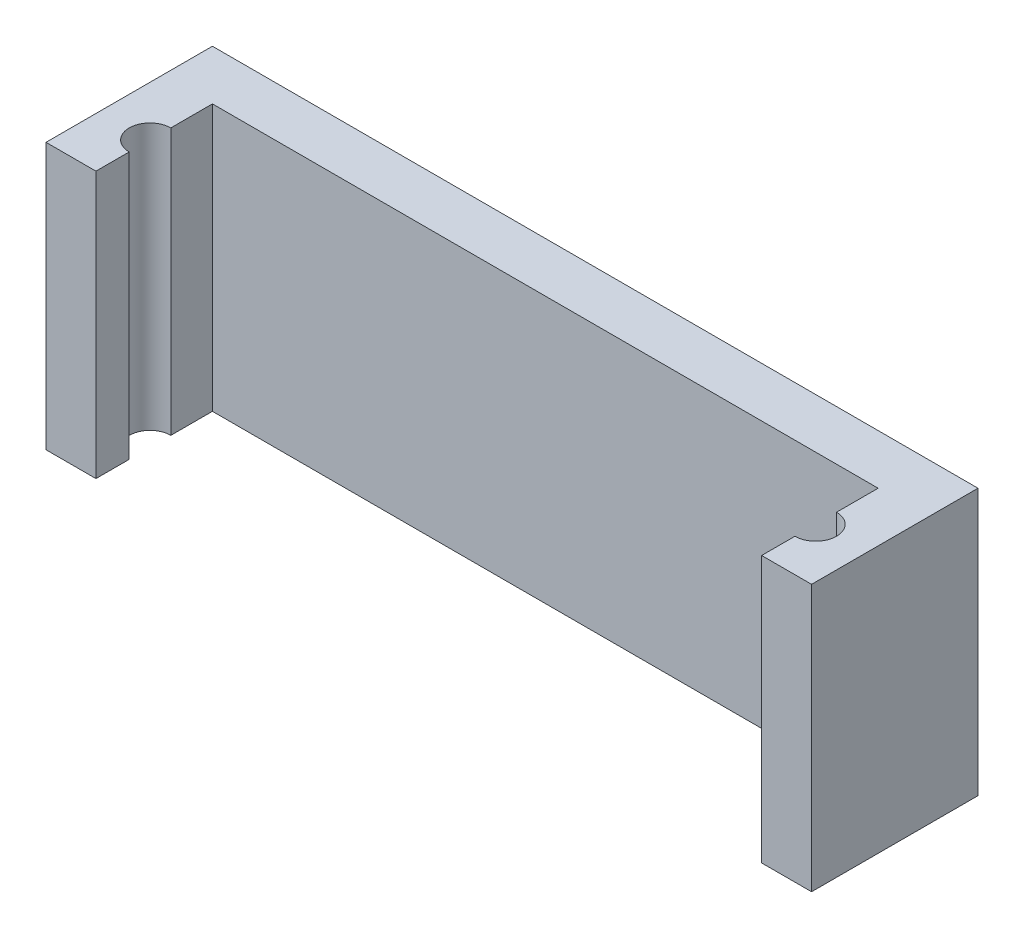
from build123d import *

# Parameters (mm, degrees)
EXTRUDE1_DEPTH = 10.16


with BuildPart() as part:
    # Sketch1 → Extrude1 (new body)
    with BuildSketch(Plane(origin=(0, 0, 0), x_dir=(1, 0, 0), z_dir=(0, 1, 0))):
        with BuildLine():
            Line((1.905, 0), (1.905, -1.27))
            Line((1.905, -1.27), (0, -1.27))
            Line((0, -1.27), (0, 0))
            Line((0, 0), (0, 5.08))
            Line((0, 5.08), (29.21, 5.08))
            Line((29.21, 5.08), (29.21, 0))
            Line((29.21, 0), (29.21, -1.27))
            Line((29.21, -1.27), (27.305, -1.27))
            Line((27.305, -1.27), (27.305, 0))
            ThreePointArc((27.305, 0), (28.09875, 0.79375), (27.305, 1.5875))
            Line((27.305, 1.5875), (27.305, 3.175))
            Line((27.305, 3.175), (1.905, 3.175))
            Line((1.905, 3.175), (1.905, 1.5875))
            ThreePointArc((1.905, 1.5875), (1.11125, 0.79375), (1.905, 0))
        make_face()
    extrude(amount=EXTRUDE1_DEPTH)


solid = part.part
